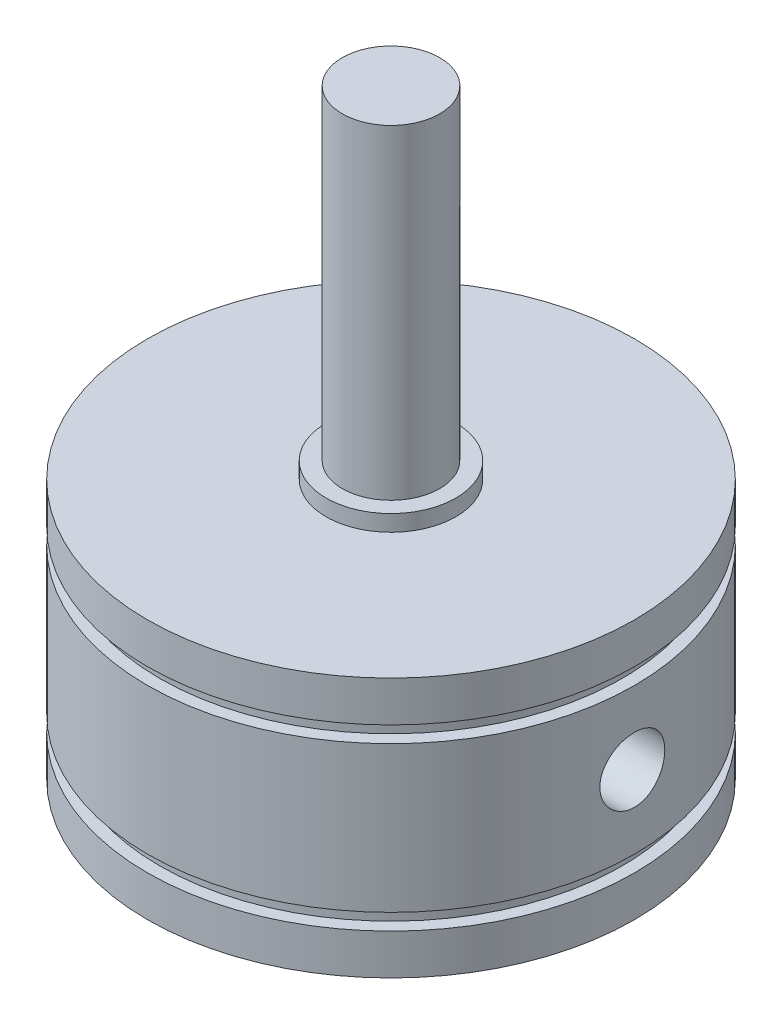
from build123d import *

# Parameters (mm, degrees)
FUROS_GUIA_COM_4_0MM1_D     = 4
FUROS_GUIA_COM_4_0MM1_DEPTH = 15
FUROS_GUIA_COM_4_0MM1_TIP   = 1.201721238
FUROS_GUIA_COM_6_0MM3_D     = 6
FUROS_GUIA_COM_6_0MM3_DEPTH = 15
FUROS_GUIA_COM_6_0MM3_TIP   = 1.802581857
FUROS_GUIA_COM_6_0MM4_D     = 6
FUROS_GUIA_COM_6_0MM4_DEPTH = 15
FUROS_GUIA_COM_6_0MM4_TIP   = 1.802581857


with BuildPart() as part:
    # Esbo_o1 → Revolu_o1 (revolve)
    with BuildSketch(Plane.XY, mode=Mode.PRIVATE) as revolu_o1_sk:
        Polygon((0, 29), (3, 29), (3, 9), (4, 9), (4, 8), (15, 8), (15, 5.5), (14.25, 5.5), (14.25, 4.5), (15, 4.5), (15, -4.5), (14.25, -4.5), (14.25, -5.5), (15, -5.5), (15, -8), (4, -8), (4, -9), (3, -9), (3, -12), (0, -12), (0, 0), align=None)
    revolve(revolu_o1_sk.sketch.rotate(Axis((0, 0, 0), (0, 1, 0)), 90), axis=Axis((0, 0, 0), (0, 1, 0)))

    # Furos-guia com _4.0mm1
    with Locations(Plane(origin=(15, 0, 0), x_dir=(0, 0, 1), z_dir=(1, 0, 0))):
        with Locations((0, 0)):
            Hole(FUROS_GUIA_COM_4_0MM1_D / 2, depth=FUROS_GUIA_COM_4_0MM1_DEPTH)
            with Locations((0, 0, -(FUROS_GUIA_COM_4_0MM1_DEPTH + FUROS_GUIA_COM_4_0MM1_TIP / 2))):  # 118° drill point
                Cone(0, FUROS_GUIA_COM_4_0MM1_D / 2, FUROS_GUIA_COM_4_0MM1_TIP, mode=Mode.SUBTRACT)

    # Furos-guia com _6.0mm3
    with Locations(Plane(origin=(-14.488887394, 0, -3.882285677), x_dir=(0.258819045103, 0, -0.965925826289), z_dir=(-0.965925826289, 0, -0.258819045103))):
        with Locations((-1e-09, 0)):
            Hole(FUROS_GUIA_COM_6_0MM3_D / 2, depth=FUROS_GUIA_COM_6_0MM3_DEPTH)
            with Locations((0, 0, -(FUROS_GUIA_COM_6_0MM3_DEPTH + FUROS_GUIA_COM_6_0MM3_TIP / 2))):  # 118° drill point
                Cone(0, FUROS_GUIA_COM_6_0MM3_D / 2, FUROS_GUIA_COM_6_0MM3_TIP, mode=Mode.SUBTRACT)

    # Furos-guia com _6.0mm4
    with Locations(Plane(origin=(-14.488887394, 0, 3.882285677), x_dir=(-0.258819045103, 0, -0.965925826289), z_dir=(-0.965925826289, 0, 0.258819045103))):
        with Locations((1e-09, 0)):
            Hole(FUROS_GUIA_COM_6_0MM4_D / 2, depth=FUROS_GUIA_COM_6_0MM4_DEPTH)
            with Locations((0, 0, -(FUROS_GUIA_COM_6_0MM4_DEPTH + FUROS_GUIA_COM_6_0MM4_TIP / 2))):  # 118° drill point
                Cone(0, FUROS_GUIA_COM_6_0MM4_D / 2, FUROS_GUIA_COM_6_0MM4_TIP, mode=Mode.SUBTRACT)


solid = part.part
